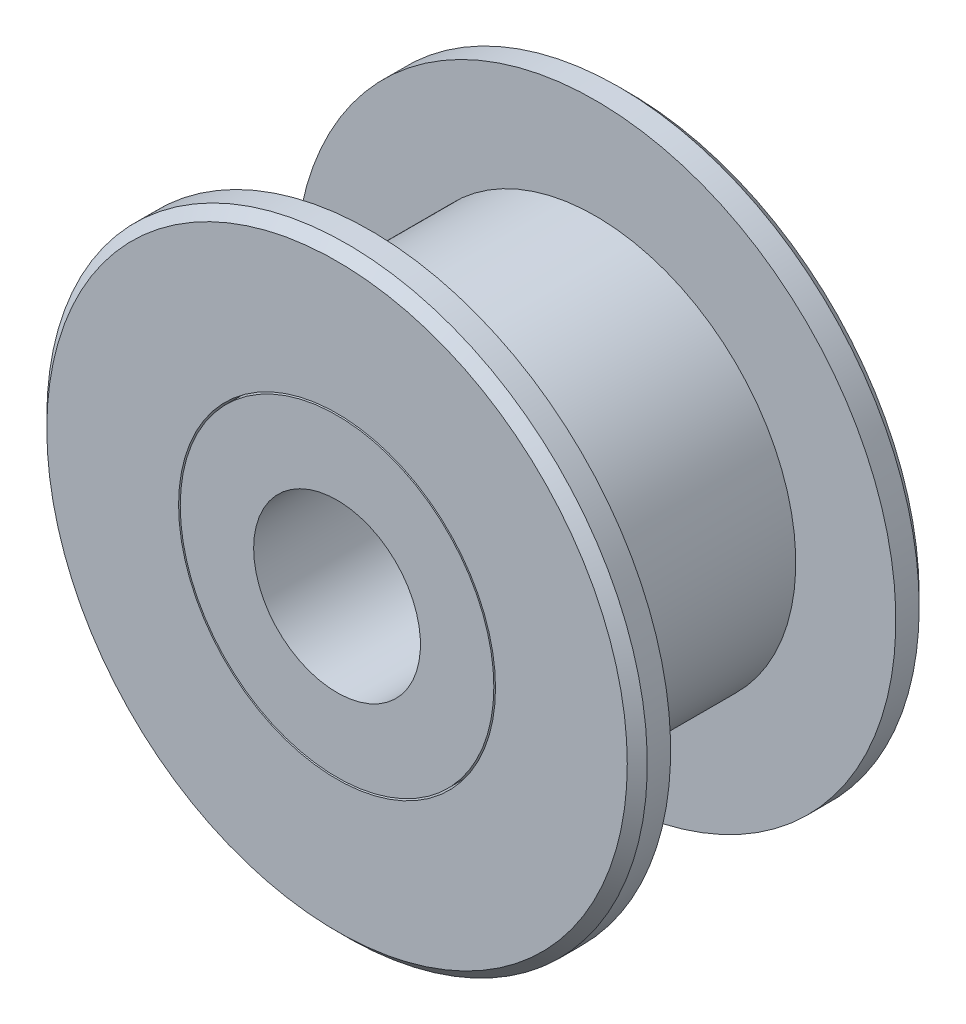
ISO-10303-21;
HEADER;
FILE_DESCRIPTION(('STEP AP214'),'2;1');
FILE_NAME('part.step','',(''),(''),'','','');
FILE_SCHEMA(('AUTOMOTIVE_DESIGN { 1 0 10303 214 1 1 1 1 }'));
ENDSEC;
DATA;
#1=APPLICATION_CONTEXT('core data for automotive mechanical design processes');
#2=APPLICATION_PROTOCOL_DEFINITION('international standard','automotive_design',2000,#1);
#3=PRODUCT_CONTEXT('',#1,'mechanical');
#4=PRODUCT('Part','Part','',(#3));
#5=PRODUCT_RELATED_PRODUCT_CATEGORY('part','',(#4));
#6=PRODUCT_DEFINITION_FORMATION('','',#4);
#7=PRODUCT_DEFINITION_CONTEXT('part definition',#1,'design');
#8=PRODUCT_DEFINITION('design','',#6,#7);
#9=PRODUCT_DEFINITION_SHAPE('','',#8);
#10=(LENGTH_UNIT() NAMED_UNIT(*) SI_UNIT(.MILLI.,.METRE.));
#11=(NAMED_UNIT(*) PLANE_ANGLE_UNIT() SI_UNIT($,.RADIAN.));
#12=(NAMED_UNIT(*) SI_UNIT($,.STERADIAN.) SOLID_ANGLE_UNIT());
#13=UNCERTAINTY_MEASURE_WITH_UNIT(LENGTH_MEASURE(1.E-05),#10,'distance_accuracy_value','');
#14=(GEOMETRIC_REPRESENTATION_CONTEXT(3) GLOBAL_UNCERTAINTY_ASSIGNED_CONTEXT((#13)) GLOBAL_UNIT_ASSIGNED_CONTEXT((#10,
#11,#12)) REPRESENTATION_CONTEXT('',''));
#15=CARTESIAN_POINT('',(0.,0.,0.));
#16=DIRECTION('',(0.,0.,1.));
#17=DIRECTION('',(1.,0.,0.));
#18=AXIS2_PLACEMENT_3D('',#15,#16,#17);
#19=CARTESIAN_POINT('',(0.,0.,8.25));
#20=DIRECTION('',(0.,0.,-1.));
#21=DIRECTION('',(-1.,0.,0.));
#22=AXIS2_PLACEMENT_3D('',#19,#20,#21);
#23=CYLINDRICAL_SURFACE('',#22,4.75);
#24=CARTESIAN_POINT('',(0.,0.,8.75));
#25=DIRECTION('',(0.,0.,-1.));
#26=DIRECTION('',(-1.,0.,0.));
#27=AXIS2_PLACEMENT_3D('',#24,#25,#26);
#28=CIRCLE('',#27,4.75);
#29=CARTESIAN_POINT('',(-4.75,0.,8.75));
#30=VERTEX_POINT('',#29);
#31=EDGE_CURVE('E18',#30,#30,#28,.T.);
#32=ORIENTED_EDGE('',*,*,#31,.F.);
#33=EDGE_LOOP('',(#32));
#34=FACE_BOUND('',#33,.T.);
#35=CARTESIAN_POINT('',(0.,0.,7.75));
#36=DIRECTION('',(0.,0.,-1.));
#37=DIRECTION('',(-1.,0.,0.));
#38=AXIS2_PLACEMENT_3D('',#35,#36,#37);
#39=CIRCLE('',#38,4.75);
#40=CARTESIAN_POINT('',(-4.75,0.,7.75));
#41=VERTEX_POINT('',#40);
#42=EDGE_CURVE('E68',#41,#41,#39,.T.);
#43=ORIENTED_EDGE('',*,*,#42,.T.);
#44=EDGE_LOOP('',(#43));
#45=FACE_BOUND('',#44,.T.);
#46=ADVANCED_FACE('F15',(#34,#45),#23,.F.);
#47=CARTESIAN_POINT('',(0.,9.,8.75));
#48=DIRECTION('',(0.,0.,1.));
#49=DIRECTION('',(1.,0.,0.));
#50=AXIS2_PLACEMENT_3D('',#47,#48,#49);
#51=PLANE('',#50);
#52=ORIENTED_EDGE('',*,*,#31,.T.);
#53=EDGE_LOOP('',(#52));
#54=FACE_BOUND('',#53,.T.);
#55=CARTESIAN_POINT('',(0.,0.,8.74999999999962));
#56=DIRECTION('',(0.,0.,-1.));
#57=DIRECTION('',(-1.,0.,0.));
#58=AXIS2_PLACEMENT_3D('',#55,#56,#57);
#59=CIRCLE('',#58,8.69999999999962);
#60=CARTESIAN_POINT('',(-8.69999999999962,0.,8.74999999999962));
#61=VERTEX_POINT('',#60);
#62=EDGE_CURVE('E66',#61,#61,#59,.T.);
#63=ORIENTED_EDGE('',*,*,#62,.F.);
#64=EDGE_LOOP('',(#63));
#65=FACE_BOUND('',#64,.T.);
#66=ADVANCED_FACE('F75',(#54,#65),#51,.T.);
#67=CARTESIAN_POINT('',(0.,4.7,7.75));
#68=DIRECTION('',(0.,0.,-1.));
#69=DIRECTION('',(-1.,0.,0.));
#70=AXIS2_PLACEMENT_3D('',#67,#68,#69);
#71=PLANE('',#70);
#72=CARTESIAN_POINT('',(0.,0.,7.75));
#73=DIRECTION('',(0.,0.,-1.));
#74=DIRECTION('',(-1.,0.,0.));
#75=AXIS2_PLACEMENT_3D('',#72,#73,#74);
#76=CIRCLE('',#75,4.7);
#77=CARTESIAN_POINT('',(-4.7,0.,7.75));
#78=VERTEX_POINT('',#77);
#79=EDGE_CURVE('E63',#78,#78,#76,.F.);
#80=ORIENTED_EDGE('',*,*,#79,.F.);
#81=EDGE_LOOP('',(#80));
#82=FACE_BOUND('',#81,.T.);
#83=ORIENTED_EDGE('',*,*,#42,.F.);
#84=EDGE_LOOP('',(#83));
#85=FACE_BOUND('',#84,.T.);
#86=ADVANCED_FACE('F83',(#82,#85),#71,.F.);
#87=CARTESIAN_POINT('',(0.,0.,8.45));
#88=DIRECTION('',(0.,0.,-1.));
#89=DIRECTION('',(-1.,0.,0.));
#90=AXIS2_PLACEMENT_3D('',#87,#88,#89);
#91=CONICAL_SURFACE('',#90,9.00000000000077,0.785398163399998);
#92=CARTESIAN_POINT('',(0.,0.,8.45));
#93=DIRECTION('',(0.,0.,-1.));
#94=DIRECTION('',(-1.,0.,0.));
#95=AXIS2_PLACEMENT_3D('',#92,#93,#94);
#96=CIRCLE('',#95,9.);
#97=CARTESIAN_POINT('',(-9.,0.,8.45));
#98=VERTEX_POINT('',#97);
#99=EDGE_CURVE('E30',#98,#98,#96,.T.);
#100=ORIENTED_EDGE('',*,*,#99,.F.);
#101=EDGE_LOOP('',(#100));
#102=FACE_BOUND('',#101,.T.);
#103=ORIENTED_EDGE('',*,*,#62,.T.);
#104=EDGE_LOOP('',(#103));
#105=FACE_BOUND('',#104,.T.);
#106=ADVANCED_FACE('F142',(#102,#105),#91,.T.);
#107=CARTESIAN_POINT('',(0.,0.,8.25));
#108=DIRECTION('',(0.,0.,-1.));
#109=DIRECTION('',(-1.,0.,0.));
#110=AXIS2_PLACEMENT_3D('',#107,#108,#109);
#111=CYLINDRICAL_SURFACE('',#110,4.7);
#112=ORIENTED_EDGE('',*,*,#79,.T.);
#113=EDGE_LOOP('',(#112));
#114=FACE_BOUND('',#113,.T.);
#115=CARTESIAN_POINT('',(0.,0.,8.75));
#116=DIRECTION('',(0.,0.,-1.));
#117=DIRECTION('',(-1.,0.,0.));
#118=AXIS2_PLACEMENT_3D('',#115,#116,#117);
#119=CIRCLE('',#118,4.7);
#120=CARTESIAN_POINT('',(-4.7,0.,8.75));
#121=VERTEX_POINT('',#120);
#122=EDGE_CURVE('E60',#121,#121,#119,.F.);
#123=ORIENTED_EDGE('',*,*,#122,.F.);
#124=EDGE_LOOP('',(#123));
#125=FACE_BOUND('',#124,.T.);
#126=ADVANCED_FACE('F138',(#114,#125),#111,.T.);
#127=CARTESIAN_POINT('',(0.,0.,8.25));
#128=DIRECTION('',(0.,0.,-1.));
#129=DIRECTION('',(-1.,0.,0.));
#130=AXIS2_PLACEMENT_3D('',#127,#128,#129);
#131=CYLINDRICAL_SURFACE('',#130,9.);
#132=ORIENTED_EDGE('',*,*,#99,.T.);
#133=EDGE_LOOP('',(#132));
#134=FACE_BOUND('',#133,.T.);
#135=CARTESIAN_POINT('',(0.,0.,7.75));
#136=DIRECTION('',(0.,0.,-1.));
#137=DIRECTION('',(-1.,0.,0.));
#138=AXIS2_PLACEMENT_3D('',#135,#136,#137);
#139=CIRCLE('',#138,9.);
#140=CARTESIAN_POINT('',(-9.,0.,7.75));
#141=VERTEX_POINT('',#140);
#142=EDGE_CURVE('E57',#141,#141,#139,.T.);
#143=ORIENTED_EDGE('',*,*,#142,.F.);
#144=EDGE_LOOP('',(#143));
#145=FACE_BOUND('',#144,.T.);
#146=ADVANCED_FACE('F134',(#134,#145),#131,.T.);
#147=CARTESIAN_POINT('',(0.,9.,8.75));
#148=DIRECTION('',(0.,0.,1.));
#149=DIRECTION('',(1.,0.,0.));
#150=AXIS2_PLACEMENT_3D('',#147,#148,#149);
#151=PLANE('',#150);
#152=CARTESIAN_POINT('',(0.,0.,8.75));
#153=DIRECTION('',(0.,0.,-1.));
#154=DIRECTION('',(-1.,0.,0.));
#155=AXIS2_PLACEMENT_3D('',#152,#153,#154);
#156=CIRCLE('',#155,2.5);
#157=CARTESIAN_POINT('',(-2.5,0.,8.75));
#158=VERTEX_POINT('',#157);
#159=EDGE_CURVE('E54',#158,#158,#156,.T.);
#160=ORIENTED_EDGE('',*,*,#159,.T.);
#161=EDGE_LOOP('',(#160));
#162=FACE_BOUND('',#161,.T.);
#163=ORIENTED_EDGE('',*,*,#122,.T.);
#164=EDGE_LOOP('',(#163));
#165=FACE_BOUND('',#164,.T.);
#166=ADVANCED_FACE('F130',(#162,#165),#151,.T.);
#167=CARTESIAN_POINT('',(0.,6.,7.75));
#168=DIRECTION('',(0.,0.,-1.));
#169=DIRECTION('',(-1.,0.,0.));
#170=AXIS2_PLACEMENT_3D('',#167,#168,#169);
#171=PLANE('',#170);
#172=CARTESIAN_POINT('',(0.,0.,7.75));
#173=DIRECTION('',(0.,0.,-1.));
#174=DIRECTION('',(-1.,0.,0.));
#175=AXIS2_PLACEMENT_3D('',#172,#173,#174);
#176=CIRCLE('',#175,6.);
#177=CARTESIAN_POINT('',(-6.,0.,7.75));
#178=VERTEX_POINT('',#177);
#179=EDGE_CURVE('E51',#178,#178,#176,.T.);
#180=ORIENTED_EDGE('',*,*,#179,.F.);
#181=EDGE_LOOP('',(#180));
#182=FACE_BOUND('',#181,.T.);
#183=ORIENTED_EDGE('',*,*,#142,.T.);
#184=EDGE_LOOP('',(#183));
#185=FACE_BOUND('',#184,.T.);
#186=ADVANCED_FACE('F126',(#182,#185),#171,.T.);
#187=CARTESIAN_POINT('',(0.,0.,4.375));
#188=DIRECTION('',(0.,0.,-1.));
#189=DIRECTION('',(-1.,0.,0.));
#190=AXIS2_PLACEMENT_3D('',#187,#188,#189);
#191=CYLINDRICAL_SURFACE('',#190,2.5);
#192=CARTESIAN_POINT('',(0.,0.,0.));
#193=DIRECTION('',(0.,0.,-1.));
#194=DIRECTION('',(-1.,0.,0.));
#195=AXIS2_PLACEMENT_3D('',#192,#193,#194);
#196=CIRCLE('',#195,2.5);
#197=CARTESIAN_POINT('',(-2.5,0.,0.));
#198=VERTEX_POINT('',#197);
#199=EDGE_CURVE('E48',#198,#198,#196,.F.);
#200=ORIENTED_EDGE('',*,*,#199,.F.);
#201=EDGE_LOOP('',(#200));
#202=FACE_BOUND('',#201,.T.);
#203=ORIENTED_EDGE('',*,*,#159,.F.);
#204=EDGE_LOOP('',(#203));
#205=FACE_BOUND('',#204,.T.);
#206=ADVANCED_FACE('F122',(#202,#205),#191,.F.);
#207=CARTESIAN_POINT('',(0.,0.,4.375));
#208=DIRECTION('',(0.,0.,-1.));
#209=DIRECTION('',(-1.,0.,0.));
#210=AXIS2_PLACEMENT_3D('',#207,#208,#209);
#211=CYLINDRICAL_SURFACE('',#210,6.);
#212=ORIENTED_EDGE('',*,*,#179,.T.);
#213=EDGE_LOOP('',(#212));
#214=FACE_BOUND('',#213,.T.);
#215=CARTESIAN_POINT('',(0.,0.,1.));
#216=DIRECTION('',(0.,0.,-1.));
#217=DIRECTION('',(-1.,0.,0.));
#218=AXIS2_PLACEMENT_3D('',#215,#216,#217);
#219=CIRCLE('',#218,6.);
#220=CARTESIAN_POINT('',(-6.,0.,1.));
#221=VERTEX_POINT('',#220);
#222=EDGE_CURVE('E45',#221,#221,#219,.T.);
#223=ORIENTED_EDGE('',*,*,#222,.F.);
#224=EDGE_LOOP('',(#223));
#225=FACE_BOUND('',#224,.T.);
#226=ADVANCED_FACE('F118',(#214,#225),#211,.T.);
#227=CARTESIAN_POINT('',(0.,2.5,0.));
#228=DIRECTION('',(0.,0.,-1.));
#229=DIRECTION('',(-1.,0.,0.));
#230=AXIS2_PLACEMENT_3D('',#227,#228,#229);
#231=PLANE('',#230);
#232=ORIENTED_EDGE('',*,*,#199,.T.);
#233=EDGE_LOOP('',(#232));
#234=FACE_BOUND('',#233,.T.);
#235=CARTESIAN_POINT('',(0.,0.,0.));
#236=DIRECTION('',(0.,0.,-1.));
#237=DIRECTION('',(-1.,0.,0.));
#238=AXIS2_PLACEMENT_3D('',#235,#236,#237);
#239=CIRCLE('',#238,4.7);
#240=CARTESIAN_POINT('',(-4.7,0.,0.));
#241=VERTEX_POINT('',#240);
#242=EDGE_CURVE('E42',#241,#241,#239,.F.);
#243=ORIENTED_EDGE('',*,*,#242,.F.);
#244=EDGE_LOOP('',(#243));
#245=FACE_BOUND('',#244,.T.);
#246=ADVANCED_FACE('F114',(#234,#245),#231,.T.);
#247=CARTESIAN_POINT('',(0.,9.,1.));
#248=DIRECTION('',(0.,0.,1.));
#249=DIRECTION('',(1.,0.,0.));
#250=AXIS2_PLACEMENT_3D('',#247,#248,#249);
#251=PLANE('',#250);
#252=ORIENTED_EDGE('',*,*,#222,.T.);
#253=EDGE_LOOP('',(#252));
#254=FACE_BOUND('',#253,.T.);
#255=CARTESIAN_POINT('',(0.,0.,1.));
#256=DIRECTION('',(0.,0.,-1.));
#257=DIRECTION('',(-1.,0.,0.));
#258=AXIS2_PLACEMENT_3D('',#255,#256,#257);
#259=CIRCLE('',#258,9.);
#260=CARTESIAN_POINT('',(-9.,0.,1.));
#261=VERTEX_POINT('',#260);
#262=EDGE_CURVE('E39',#261,#261,#259,.T.);
#263=ORIENTED_EDGE('',*,*,#262,.F.);
#264=EDGE_LOOP('',(#263));
#265=FACE_BOUND('',#264,.T.);
#266=ADVANCED_FACE('F110',(#254,#265),#251,.T.);
#267=CARTESIAN_POINT('',(0.,0.,0.5));
#268=DIRECTION('',(0.,0.,-1.));
#269=DIRECTION('',(-1.,0.,0.));
#270=AXIS2_PLACEMENT_3D('',#267,#268,#269);
#271=CYLINDRICAL_SURFACE('',#270,4.7);
#272=ORIENTED_EDGE('',*,*,#242,.T.);
#273=EDGE_LOOP('',(#272));
#274=FACE_BOUND('',#273,.T.);
#275=CARTESIAN_POINT('',(0.,0.,1.));
#276=DIRECTION('',(0.,0.,-1.));
#277=DIRECTION('',(-1.,0.,0.));
#278=AXIS2_PLACEMENT_3D('',#275,#276,#277);
#279=CIRCLE('',#278,4.7);
#280=CARTESIAN_POINT('',(-4.7,0.,1.));
#281=VERTEX_POINT('',#280);
#282=EDGE_CURVE('E36',#281,#281,#279,.T.);
#283=ORIENTED_EDGE('',*,*,#282,.T.);
#284=EDGE_LOOP('',(#283));
#285=FACE_BOUND('',#284,.T.);
#286=ADVANCED_FACE('F106',(#274,#285),#271,.T.);
#287=CARTESIAN_POINT('',(0.,0.,0.5));
#288=DIRECTION('',(0.,0.,-1.));
#289=DIRECTION('',(-1.,0.,0.));
#290=AXIS2_PLACEMENT_3D('',#287,#288,#289);
#291=CYLINDRICAL_SURFACE('',#290,9.);
#292=ORIENTED_EDGE('',*,*,#262,.T.);
#293=EDGE_LOOP('',(#292));
#294=FACE_BOUND('',#293,.T.);
#295=CARTESIAN_POINT('',(0.,0.,0.300000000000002));
#296=DIRECTION('',(0.,0.,1.));
#297=DIRECTION('',(0.,-1.,0.));
#298=AXIS2_PLACEMENT_3D('',#295,#296,#297);
#299=CIRCLE('',#298,9.00000000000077);
#300=CARTESIAN_POINT('',(0.,-9.00000000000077,0.300000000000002));
#301=VERTEX_POINT('',#300);
#302=EDGE_CURVE('E35',#301,#301,#299,.F.);
#303=ORIENTED_EDGE('',*,*,#302,.F.);
#304=EDGE_LOOP('',(#303));
#305=FACE_BOUND('',#304,.T.);
#306=ADVANCED_FACE('F102',(#294,#305),#291,.T.);
#307=CARTESIAN_POINT('',(0.,4.75,1.));
#308=DIRECTION('',(0.,0.,1.));
#309=DIRECTION('',(1.,0.,0.));
#310=AXIS2_PLACEMENT_3D('',#307,#308,#309);
#311=PLANE('',#310);
#312=ORIENTED_EDGE('',*,*,#282,.F.);
#313=EDGE_LOOP('',(#312));
#314=FACE_BOUND('',#313,.T.);
#315=CARTESIAN_POINT('',(0.,0.,1.));
#316=DIRECTION('',(0.,0.,-1.));
#317=DIRECTION('',(-1.,0.,0.));
#318=AXIS2_PLACEMENT_3D('',#315,#316,#317);
#319=CIRCLE('',#318,4.75);
#320=CARTESIAN_POINT('',(-4.75,0.,1.));
#321=VERTEX_POINT('',#320);
#322=EDGE_CURVE('E27',#321,#321,#319,.T.);
#323=ORIENTED_EDGE('',*,*,#322,.T.);
#324=EDGE_LOOP('',(#323));
#325=FACE_BOUND('',#324,.T.);
#326=ADVANCED_FACE('F98',(#314,#325),#311,.F.);
#327=CARTESIAN_POINT('',(0.,0.,0.300000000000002));
#328=DIRECTION('',(0.,0.,1.));
#329=DIRECTION('',(1.,0.,0.));
#330=AXIS2_PLACEMENT_3D('',#327,#328,#329);
#331=CONICAL_SURFACE('',#330,9.00000000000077,0.785398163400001);
#332=CARTESIAN_POINT('',(0.,0.,3.814223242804E-13));
#333=DIRECTION('',(0.,0.,1.));
#334=DIRECTION('',(1.,0.,0.));
#335=AXIS2_PLACEMENT_3D('',#332,#333,#334);
#336=CIRCLE('',#335,8.69999999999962);
#337=CARTESIAN_POINT('',(8.69999999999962,0.,3.814223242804E-13));
#338=VERTEX_POINT('',#337);
#339=EDGE_CURVE('E22',#338,#338,#336,.F.);
#340=ORIENTED_EDGE('',*,*,#339,.F.);
#341=EDGE_LOOP('',(#340));
#342=FACE_BOUND('',#341,.T.);
#343=ORIENTED_EDGE('',*,*,#302,.T.);
#344=EDGE_LOOP('',(#343));
#345=FACE_BOUND('',#344,.T.);
#346=ADVANCED_FACE('F91',(#342,#345),#331,.T.);
#347=CARTESIAN_POINT('',(0.,0.,0.5));
#348=DIRECTION('',(0.,0.,-1.));
#349=DIRECTION('',(-1.,0.,0.));
#350=AXIS2_PLACEMENT_3D('',#347,#348,#349);
#351=CYLINDRICAL_SURFACE('',#350,4.75);
#352=ORIENTED_EDGE('',*,*,#322,.F.);
#353=EDGE_LOOP('',(#352));
#354=FACE_BOUND('',#353,.T.);
#355=CARTESIAN_POINT('',(0.,0.,0.));
#356=DIRECTION('',(0.,0.,-1.));
#357=DIRECTION('',(-1.,0.,0.));
#358=AXIS2_PLACEMENT_3D('',#355,#356,#357);
#359=CIRCLE('',#358,4.75);
#360=CARTESIAN_POINT('',(-4.75,0.,0.));
#361=VERTEX_POINT('',#360);
#362=EDGE_CURVE('E10',#361,#361,#359,.F.);
#363=ORIENTED_EDGE('',*,*,#362,.F.);
#364=EDGE_LOOP('',(#363));
#365=FACE_BOUND('',#364,.T.);
#366=ADVANCED_FACE('F86',(#354,#365),#351,.F.);
#367=CARTESIAN_POINT('',(0.,2.5,0.));
#368=DIRECTION('',(0.,0.,-1.));
#369=DIRECTION('',(-1.,0.,0.));
#370=AXIS2_PLACEMENT_3D('',#367,#368,#369);
#371=PLANE('',#370);
#372=ORIENTED_EDGE('',*,*,#362,.T.);
#373=EDGE_LOOP('',(#372));
#374=FACE_BOUND('',#373,.T.);
#375=ORIENTED_EDGE('',*,*,#339,.T.);
#376=EDGE_LOOP('',(#375));
#377=FACE_BOUND('',#376,.T.);
#378=ADVANCED_FACE('F84',(#374,#377),#371,.T.);
#379=CLOSED_SHELL('',(#46,#66,#86,#106,#126,#146,#166,#186,#206,#226,#246,#266,#286,#306,#326,
#346,#366,#378));
#380=MANIFOLD_SOLID_BREP('B1',#379);
#381=ADVANCED_BREP_SHAPE_REPRESENTATION('',(#18,#380),#14);
#382=SHAPE_DEFINITION_REPRESENTATION(#9,#381);
ENDSEC;
END-ISO-10303-21;
